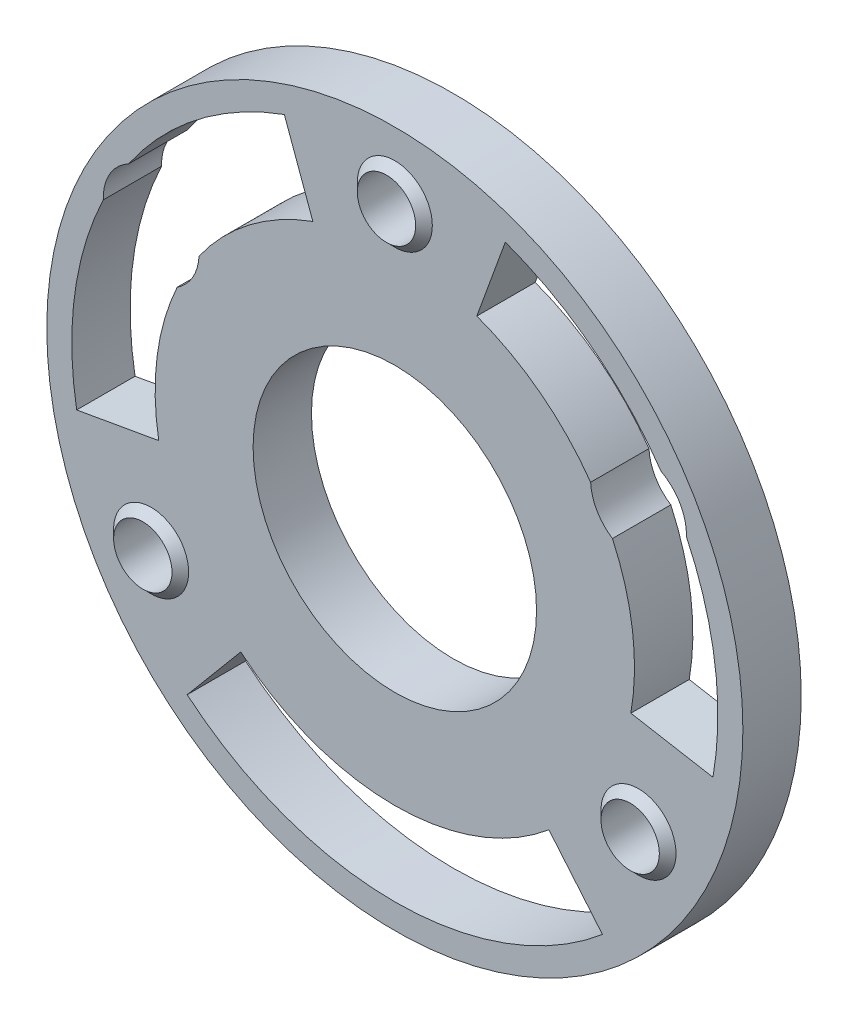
ISO-10303-21;
HEADER;
FILE_DESCRIPTION(('STEP AP214'),'2;1');
FILE_NAME('part.step','',(''),(''),'','','');
FILE_SCHEMA(('AUTOMOTIVE_DESIGN { 1 0 10303 214 1 1 1 1 }'));
ENDSEC;
DATA;
#1=APPLICATION_CONTEXT('core data for automotive mechanical design processes');
#2=APPLICATION_PROTOCOL_DEFINITION('international standard','automotive_design',2000,#1);
#3=PRODUCT_CONTEXT('',#1,'mechanical');
#4=PRODUCT('Part','Part','',(#3));
#5=PRODUCT_RELATED_PRODUCT_CATEGORY('part','',(#4));
#6=PRODUCT_DEFINITION_FORMATION('','',#4);
#7=PRODUCT_DEFINITION_CONTEXT('part definition',#1,'design');
#8=PRODUCT_DEFINITION('design','',#6,#7);
#9=PRODUCT_DEFINITION_SHAPE('','',#8);
#10=(LENGTH_UNIT() NAMED_UNIT(*) SI_UNIT(.MILLI.,.METRE.));
#11=(NAMED_UNIT(*) PLANE_ANGLE_UNIT() SI_UNIT($,.RADIAN.));
#12=(NAMED_UNIT(*) SI_UNIT($,.STERADIAN.) SOLID_ANGLE_UNIT());
#13=UNCERTAINTY_MEASURE_WITH_UNIT(LENGTH_MEASURE(1.E-05),#10,'distance_accuracy_value','');
#14=(GEOMETRIC_REPRESENTATION_CONTEXT(3) GLOBAL_UNCERTAINTY_ASSIGNED_CONTEXT((#13)) GLOBAL_UNIT_ASSIGNED_CONTEXT((#10,
#11,#12)) REPRESENTATION_CONTEXT('',''));
#15=CARTESIAN_POINT('',(0.,0.,0.));
#16=DIRECTION('',(0.,0.,1.));
#17=DIRECTION('',(1.,0.,0.));
#18=AXIS2_PLACEMENT_3D('',#15,#16,#17);
#19=CARTESIAN_POINT('',(0.,0.,3.5));
#20=DIRECTION('',(0.,0.,-1.));
#21=DIRECTION('',(-1.,0.,0.));
#22=AXIS2_PLACEMENT_3D('',#19,#20,#21);
#23=CYLINDRICAL_SURFACE('',#22,14.375);
#24=DIRECTION('',(0.,0.,-1.));
#25=VECTOR('',#24,1.);
#26=CARTESIAN_POINT('',(-11.7429006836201,8.2912549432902,2.));
#27=LINE('',#26,#25);
#28=CARTESIAN_POINT('',(-11.7429006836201,8.2912549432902,3.5));
#29=VERTEX_POINT('',#28);
#30=CARTESIAN_POINT('',(-11.7429006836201,8.2912549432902,0.));
#31=VERTEX_POINT('',#30);
#32=EDGE_CURVE('E435',#29,#31,#27,.T.);
#33=ORIENTED_EDGE('',*,*,#32,.F.);
#34=CARTESIAN_POINT('',(0.,0.,3.5));
#35=DIRECTION('',(0.,0.,-1.));
#36=DIRECTION('',(-1.,0.,0.));
#37=AXIS2_PLACEMENT_3D('',#34,#35,#36);
#38=CIRCLE('',#37,14.375);
#39=CARTESIAN_POINT('',(-4.9165395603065,13.5080814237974,3.5));
#40=VERTEX_POINT('',#39);
#41=EDGE_CURVE('E247',#29,#40,#38,.T.);
#42=ORIENTED_EDGE('',*,*,#41,.T.);
#43=DIRECTION('',(0.,0.,-1.));
#44=VECTOR('',#43,1.);
#45=CARTESIAN_POINT('',(-4.9165395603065,13.5080814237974,3.5));
#46=LINE('',#45,#44);
#47=CARTESIAN_POINT('',(-4.9165395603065,13.5080814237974,0.));
#48=VERTEX_POINT('',#47);
#49=EDGE_CURVE('E286',#40,#48,#46,.T.);
#50=ORIENTED_EDGE('',*,*,#49,.T.);
#51=CARTESIAN_POINT('',(0.,0.,0.));
#52=DIRECTION('',(0.,0.,-1.));
#53=DIRECTION('',(-1.,0.,0.));
#54=AXIS2_PLACEMENT_3D('',#51,#52,#53);
#55=CIRCLE('',#54,14.375);
#56=EDGE_CURVE('E241',#31,#48,#55,.T.);
#57=ORIENTED_EDGE('',*,*,#56,.F.);
#58=EDGE_LOOP('',(#33,#42,#50,#57));
#59=FACE_BOUND('',#58,.T.);
#60=ADVANCED_FACE('F45',(#59),#23,.T.);
#61=CARTESIAN_POINT('',(1.17961196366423E-13,0.,3.5));
#62=DIRECTION('',(0.,0.,-1.));
#63=DIRECTION('',(-1.,0.,0.));
#64=AXIS2_PLACEMENT_3D('',#61,#62,#63);
#65=CYLINDRICAL_SURFACE('',#64,19.3750000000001);
#66=DIRECTION('',(0.,0.,-1.));
#67=VECTOR('',#66,1.);
#68=CARTESIAN_POINT('',(-15.9674769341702,10.9740742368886,2.));
#69=LINE('',#68,#67);
#70=CARTESIAN_POINT('',(-15.9674769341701,10.9740742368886,0.));
#71=VERTEX_POINT('',#70);
#72=CARTESIAN_POINT('',(-15.9674769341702,10.9740742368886,3.5));
#73=VERTEX_POINT('',#72);
#74=EDGE_CURVE('E11',#71,#73,#69,.F.);
#75=ORIENTED_EDGE('',*,*,#74,.F.);
#76=CARTESIAN_POINT('',(1.17961196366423E-13,0.,0.));
#77=DIRECTION('',(0.,0.,1.));
#78=DIRECTION('',(-1.,0.,0.));
#79=AXIS2_PLACEMENT_3D('',#76,#77,#78);
#80=CIRCLE('',#79,19.3750000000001);
#81=CARTESIAN_POINT('',(-6.62664027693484,18.206544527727,0.));
#82=VERTEX_POINT('',#81);
#83=EDGE_CURVE('E268',#82,#71,#80,.T.);
#84=ORIENTED_EDGE('',*,*,#83,.F.);
#85=DIRECTION('',(0.,0.,-1.));
#86=VECTOR('',#85,1.);
#87=CARTESIAN_POINT('',(-6.62664027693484,18.206544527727,3.5));
#88=LINE('',#87,#86);
#89=CARTESIAN_POINT('',(-6.62664027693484,18.206544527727,3.5));
#90=VERTEX_POINT('',#89);
#91=EDGE_CURVE('E283',#90,#82,#88,.T.);
#92=ORIENTED_EDGE('',*,*,#91,.F.);
#93=CARTESIAN_POINT('',(1.17961196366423E-13,0.,3.5));
#94=DIRECTION('',(0.,0.,1.));
#95=DIRECTION('',(-1.,0.,0.));
#96=AXIS2_PLACEMENT_3D('',#93,#94,#95);
#97=CIRCLE('',#96,19.3750000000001);
#98=EDGE_CURVE('E251',#90,#73,#97,.T.);
#99=ORIENTED_EDGE('',*,*,#98,.T.);
#100=EDGE_LOOP('',(#75,#84,#92,#99));
#101=FACE_BOUND('',#100,.T.);
#102=ADVANCED_FACE('F486',(#101),#65,.F.);
#103=CARTESIAN_POINT('',(0.,0.,3.5));
#104=DIRECTION('',(0.,0.,-1.));
#105=DIRECTION('',(-1.,0.,0.));
#106=AXIS2_PLACEMENT_3D('',#103,#104,#105);
#107=CYLINDRICAL_SURFACE('',#106,14.375);
#108=DIRECTION('',(0.,0.,-1.));
#109=VECTOR('',#108,1.);
#110=CARTESIAN_POINT('',(13.0518877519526,6.02402283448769,2.));
#111=LINE('',#110,#109);
#112=CARTESIAN_POINT('',(13.0518877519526,6.02402283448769,3.5));
#113=VERTEX_POINT('',#112);
#114=CARTESIAN_POINT('',(13.0518877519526,6.02402283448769,0.));
#115=VERTEX_POINT('',#114);
#116=EDGE_CURVE('E444',#113,#115,#111,.T.);
#117=ORIENTED_EDGE('',*,*,#116,.F.);
#118=CARTESIAN_POINT('',(0.,0.,3.5));
#119=DIRECTION('',(0.,0.,-1.));
#120=DIRECTION('',(-1.,0.,0.));
#121=AXIS2_PLACEMENT_3D('',#118,#119,#120);
#122=CIRCLE('',#121,14.375);
#123=CARTESIAN_POINT('',(14.1566114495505,-2.49619255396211,3.5));
#124=VERTEX_POINT('',#123);
#125=EDGE_CURVE('E226',#113,#124,#122,.T.);
#126=ORIENTED_EDGE('',*,*,#125,.T.);
#127=DIRECTION('',(0.,0.,-1.));
#128=VECTOR('',#127,1.);
#129=CARTESIAN_POINT('',(14.1566114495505,-2.49619255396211,3.5));
#130=LINE('',#129,#128);
#131=CARTESIAN_POINT('',(14.1566114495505,-2.49619255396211,0.));
#132=VERTEX_POINT('',#131);
#133=EDGE_CURVE('E237',#124,#132,#130,.T.);
#134=ORIENTED_EDGE('',*,*,#133,.T.);
#135=CARTESIAN_POINT('',(0.,0.,0.));
#136=DIRECTION('',(0.,0.,-1.));
#137=DIRECTION('',(-1.,0.,0.));
#138=AXIS2_PLACEMENT_3D('',#135,#136,#137);
#139=CIRCLE('',#138,14.375);
#140=EDGE_CURVE('E360',#115,#132,#139,.T.);
#141=ORIENTED_EDGE('',*,*,#140,.F.);
#142=EDGE_LOOP('',(#117,#126,#134,#141));
#143=FACE_BOUND('',#142,.T.);
#144=ADVANCED_FACE('F459',(#143),#107,.T.);
#145=CARTESIAN_POINT('',(1.17961196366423E-13,0.,3.5));
#146=DIRECTION('',(0.,0.,-1.));
#147=DIRECTION('',(-1.,0.,0.));
#148=AXIS2_PLACEMENT_3D('',#145,#146,#147);
#149=CYLINDRICAL_SURFACE('',#148,19.3749999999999);
#150=DIRECTION('',(0.,0.,-1.));
#151=VECTOR('',#150,1.);
#152=CARTESIAN_POINT('',(17.4875655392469,8.3412035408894,2.));
#153=LINE('',#152,#151);
#154=CARTESIAN_POINT('',(17.4875655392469,8.34120354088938,0.));
#155=VERTEX_POINT('',#154);
#156=CARTESIAN_POINT('',(17.4875655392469,8.3412035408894,3.5));
#157=VERTEX_POINT('',#156);
#158=EDGE_CURVE('E193',#155,#157,#153,.F.);
#159=ORIENTED_EDGE('',*,*,#158,.F.);
#160=CARTESIAN_POINT('',(1.17961196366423E-13,0.,0.));
#161=DIRECTION('',(0.,0.,1.));
#162=DIRECTION('',(-1.,0.,0.));
#163=AXIS2_PLACEMENT_3D('',#160,#161,#162);
#164=CIRCLE('',#163,19.3749999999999);
#165=CARTESIAN_POINT('',(19.0806502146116,-3.36443344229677,0.));
#166=VERTEX_POINT('',#165);
#167=EDGE_CURVE('E206',#166,#155,#164,.T.);
#168=ORIENTED_EDGE('',*,*,#167,.F.);
#169=DIRECTION('',(0.,0.,-1.));
#170=VECTOR('',#169,1.);
#171=CARTESIAN_POINT('',(19.0806502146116,-3.36443344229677,3.5));
#172=LINE('',#171,#170);
#173=CARTESIAN_POINT('',(19.0806502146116,-3.36443344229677,3.5));
#174=VERTEX_POINT('',#173);
#175=EDGE_CURVE('E234',#174,#166,#172,.T.);
#176=ORIENTED_EDGE('',*,*,#175,.F.);
#177=CARTESIAN_POINT('',(1.17961196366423E-13,0.,3.5));
#178=DIRECTION('',(0.,0.,1.));
#179=DIRECTION('',(-1.,0.,0.));
#180=AXIS2_PLACEMENT_3D('',#177,#178,#179);
#181=CIRCLE('',#180,19.3749999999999);
#182=EDGE_CURVE('E338',#174,#157,#181,.T.);
#183=ORIENTED_EDGE('',*,*,#182,.T.);
#184=EDGE_LOOP('',(#159,#168,#176,#183));
#185=FACE_BOUND('',#184,.T.);
#186=ADVANCED_FACE('F468',(#185),#149,.F.);
#187=CARTESIAN_POINT('',(1.17961196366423E-13,0.,3.5));
#188=DIRECTION('',(0.,0.,1.));
#189=DIRECTION('',(1.,0.,0.));
#190=AXIS2_PLACEMENT_3D('',#187,#188,#189);
#191=PLANE('',#190);
#192=CARTESIAN_POINT('',(14.6141786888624,8.43750000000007,3.5));
#193=DIRECTION('',(0.,0.,1.));
#194=DIRECTION('',(1.,0.,0.));
#195=AXIS2_PLACEMENT_3D('',#192,#193,#194);
#196=CIRCLE('',#195,2.875);
#197=CARTESIAN_POINT('',(11.7429006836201,8.2912549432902,3.5));
#198=VERTEX_POINT('',#197);
#199=EDGE_CURVE('E447',#198,#113,#196,.T.);
#200=ORIENTED_EDGE('',*,*,#199,.F.);
#201=CARTESIAN_POINT('',(4.91653956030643,13.5080814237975,3.5));
#202=VERTEX_POINT('',#201);
#203=EDGE_CURVE('E347',#202,#198,#122,.T.);
#204=ORIENTED_EDGE('',*,*,#203,.F.);
#205=DIRECTION('',(-0.342020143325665,-0.93969262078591,0.));
#206=VECTOR('',#205,1.);
#207=CARTESIAN_POINT('',(6.62664027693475,18.206544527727,3.5));
#208=LINE('',#207,#206);
#209=CARTESIAN_POINT('',(6.62664027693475,18.206544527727,3.5));
#210=VERTEX_POINT('',#209);
#211=EDGE_CURVE('E231',#210,#202,#208,.T.);
#212=ORIENTED_EDGE('',*,*,#211,.F.);
#213=CARTESIAN_POINT('',(15.9674769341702,10.9740742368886,3.5));
#214=VERTEX_POINT('',#213);
#215=EDGE_CURVE('E342',#214,#210,#181,.T.);
#216=ORIENTED_EDGE('',*,*,#215,.F.);
#217=EDGE_CURVE('E188',#157,#214,#196,.T.);
#218=ORIENTED_EDGE('',*,*,#217,.F.);
#219=ORIENTED_EDGE('',*,*,#182,.F.);
#220=DIRECTION('',(0.984807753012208,-0.173648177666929,0.));
#221=VECTOR('',#220,1.);
#222=CARTESIAN_POINT('',(19.0806502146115,-3.36443344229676,3.5));
#223=LINE('',#222,#221);
#224=EDGE_CURVE('E345',#124,#174,#223,.T.);
#225=ORIENTED_EDGE('',*,*,#224,.F.);
#226=ORIENTED_EDGE('',*,*,#125,.F.);
#227=EDGE_LOOP('',(#200,#204,#212,#216,#218,#219,#225,#226));
#228=FACE_BOUND('',#227,.T.);
#229=CARTESIAN_POINT('',(-14.6141786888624,8.43750000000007,3.5));
#230=DIRECTION('',(0.,0.,1.));
#231=DIRECTION('',(1.,0.,0.));
#232=AXIS2_PLACEMENT_3D('',#229,#230,#231);
#233=CIRCLE('',#232,2.875);
#234=CARTESIAN_POINT('',(-17.4875655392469,8.34120354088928,3.5));
#235=VERTEX_POINT('',#234);
#236=EDGE_CURVE('E69',#73,#235,#233,.T.);
#237=ORIENTED_EDGE('',*,*,#236,.F.);
#238=ORIENTED_EDGE('',*,*,#98,.F.);
#239=DIRECTION('',(-0.342020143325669,0.939692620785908,0.));
#240=VECTOR('',#239,1.);
#241=CARTESIAN_POINT('',(-6.62664027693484,18.206544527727,3.5));
#242=LINE('',#241,#240);
#243=EDGE_CURVE('E246',#40,#90,#242,.T.);
#244=ORIENTED_EDGE('',*,*,#243,.F.);
#245=ORIENTED_EDGE('',*,*,#41,.F.);
#246=CARTESIAN_POINT('',(-13.0518877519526,6.02402283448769,3.5));
#247=VERTEX_POINT('',#246);
#248=EDGE_CURVE('E438',#247,#29,#233,.T.);
#249=ORIENTED_EDGE('',*,*,#248,.F.);
#250=CARTESIAN_POINT('',(-14.1566114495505,-2.49619255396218,3.5));
#251=VERTEX_POINT('',#250);
#252=EDGE_CURVE('E242',#251,#247,#38,.T.);
#253=ORIENTED_EDGE('',*,*,#252,.F.);
#254=DIRECTION('',(0.984807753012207,0.173648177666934,0.));
#255=VECTOR('',#254,1.);
#256=CARTESIAN_POINT('',(-19.0806502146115,-3.36443344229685,3.5));
#257=LINE('',#256,#255);
#258=CARTESIAN_POINT('',(-19.0806502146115,-3.36443344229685,3.5));
#259=VERTEX_POINT('',#258);
#260=EDGE_CURVE('E255',#259,#251,#257,.T.);
#261=ORIENTED_EDGE('',*,*,#260,.F.);
#262=EDGE_CURVE('E250',#235,#259,#97,.T.);
#263=ORIENTED_EDGE('',*,*,#262,.F.);
#264=EDGE_LOOP('',(#237,#238,#244,#245,#249,#253,#261,#263));
#265=FACE_BOUND('',#264,.T.);
#266=CARTESIAN_POINT('',(-14.6141786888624,-8.43750000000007,3.5));
#267=DIRECTION('',(0.,0.,1.));
#268=DIRECTION('',(1.,0.,0.));
#269=AXIS2_PLACEMENT_3D('',#266,#267,#268);
#270=CIRCLE('',#269,2.25);
#271=CARTESIAN_POINT('',(-12.3641786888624,-8.43750000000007,3.5));
#272=VERTEX_POINT('',#271);
#273=EDGE_CURVE('E423',#272,#272,#270,.T.);
#274=ORIENTED_EDGE('',*,*,#273,.F.);
#275=EDGE_LOOP('',(#274));
#276=FACE_BOUND('',#275,.T.);
#277=DIRECTION('',(-0.642787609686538,-0.766044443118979,0.));
#278=VECTOR('',#277,1.);
#279=CARTESIAN_POINT('',(-12.4540099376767,-14.8421110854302,3.5));
#280=LINE('',#279,#278);
#281=CARTESIAN_POINT('',(-9.24007188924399,-11.0118888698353,3.5));
#282=VERTEX_POINT('',#281);
#283=CARTESIAN_POINT('',(-12.4540099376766,-14.8421110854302,3.5));
#284=VERTEX_POINT('',#283);
#285=EDGE_CURVE('E407',#282,#284,#280,.T.);
#286=ORIENTED_EDGE('',*,*,#285,.F.);
#287=CARTESIAN_POINT('',(0.,0.,3.5));
#288=DIRECTION('',(0.,0.,-1.));
#289=DIRECTION('',(-1.,0.,0.));
#290=AXIS2_PLACEMENT_3D('',#287,#288,#289);
#291=CIRCLE('',#290,14.375);
#292=CARTESIAN_POINT('',(9.24007188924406,-11.0118888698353,3.5));
#293=VERTEX_POINT('',#292);
#294=EDGE_CURVE('E388',#293,#282,#291,.T.);
#295=ORIENTED_EDGE('',*,*,#294,.F.);
#296=DIRECTION('',(-0.642787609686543,0.766044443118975,0.));
#297=VECTOR('',#296,1.);
#298=CARTESIAN_POINT('',(12.4540099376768,-14.8421110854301,3.5));
#299=LINE('',#298,#297);
#300=CARTESIAN_POINT('',(12.4540099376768,-14.8421110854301,3.5));
#301=VERTEX_POINT('',#300);
#302=EDGE_CURVE('E383',#301,#293,#299,.T.);
#303=ORIENTED_EDGE('',*,*,#302,.F.);
#304=CARTESIAN_POINT('',(1.17961196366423E-13,0.,3.5));
#305=DIRECTION('',(0.,0.,1.));
#306=DIRECTION('',(-1.,0.,0.));
#307=AXIS2_PLACEMENT_3D('',#304,#305,#306);
#308=CIRCLE('',#307,19.3749999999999);
#309=EDGE_CURVE('E403',#284,#301,#308,.T.);
#310=ORIENTED_EDGE('',*,*,#309,.F.);
#311=EDGE_LOOP('',(#286,#295,#303,#310));
#312=FACE_BOUND('',#311,.T.);
#313=CARTESIAN_POINT('',(1.17961196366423E-13,0.,3.5));
#314=DIRECTION('',(0.,0.,1.));
#315=DIRECTION('',(1.,0.,0.));
#316=AXIS2_PLACEMENT_3D('',#313,#314,#315);
#317=CIRCLE('',#316,20.875);
#318=CARTESIAN_POINT('',(20.8750000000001,0.,3.5));
#319=VERTEX_POINT('',#318);
#320=EDGE_CURVE('E194',#319,#319,#317,.T.);
#321=ORIENTED_EDGE('',*,*,#320,.T.);
#322=EDGE_LOOP('',(#321));
#323=FACE_BOUND('',#322,.T.);
#324=CARTESIAN_POINT('',(1.17961196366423E-13,0.,3.5));
#325=DIRECTION('',(0.,0.,1.));
#326=DIRECTION('',(1.,0.,0.));
#327=AXIS2_PLACEMENT_3D('',#324,#325,#326);
#328=CIRCLE('',#327,8.49999999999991);
#329=CARTESIAN_POINT('',(8.50000000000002,0.,3.5));
#330=VERTEX_POINT('',#329);
#331=EDGE_CURVE('E303',#330,#330,#328,.T.);
#332=ORIENTED_EDGE('',*,*,#331,.F.);
#333=EDGE_LOOP('',(#332));
#334=FACE_BOUND('',#333,.T.);
#335=CARTESIAN_POINT('',(0.,16.875,3.5));
#336=DIRECTION('',(0.,0.,1.));
#337=DIRECTION('',(1.,0.,0.));
#338=AXIS2_PLACEMENT_3D('',#335,#336,#337);
#339=CIRCLE('',#338,2.25);
#340=CARTESIAN_POINT('',(2.25,16.875,3.5));
#341=VERTEX_POINT('',#340);
#342=EDGE_CURVE('E400',#341,#341,#339,.T.);
#343=ORIENTED_EDGE('',*,*,#342,.F.);
#344=EDGE_LOOP('',(#343));
#345=FACE_BOUND('',#344,.T.);
#346=CARTESIAN_POINT('',(14.6141786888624,-8.43750000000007,3.5));
#347=DIRECTION('',(0.,0.,1.));
#348=DIRECTION('',(1.,0.,0.));
#349=AXIS2_PLACEMENT_3D('',#346,#347,#348);
#350=CIRCLE('',#349,2.25);
#351=CARTESIAN_POINT('',(16.8641786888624,-8.43750000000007,3.5));
#352=VERTEX_POINT('',#351);
#353=EDGE_CURVE('E431',#352,#352,#350,.T.);
#354=ORIENTED_EDGE('',*,*,#353,.F.);
#355=EDGE_LOOP('',(#354));
#356=FACE_BOUND('',#355,.T.);
#357=ADVANCED_FACE('F461',(#228,#265,#276,#312,#323,#334,#345,#356),#191,.T.);
#358=CARTESIAN_POINT('',(1.17961196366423E-13,0.,0.));
#359=DIRECTION('',(0.,0.,1.));
#360=DIRECTION('',(1.,0.,0.));
#361=AXIS2_PLACEMENT_3D('',#358,#359,#360);
#362=PLANE('',#361);
#363=CARTESIAN_POINT('',(4.91653956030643,13.5080814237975,0.));
#364=VERTEX_POINT('',#363);
#365=CARTESIAN_POINT('',(11.7429006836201,8.29125494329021,0.));
#366=VERTEX_POINT('',#365);
#367=EDGE_CURVE('E220',#364,#366,#139,.T.);
#368=ORIENTED_EDGE('',*,*,#367,.T.);
#369=CARTESIAN_POINT('',(14.6141786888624,8.43750000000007,0.));
#370=DIRECTION('',(0.,0.,-1.));
#371=DIRECTION('',(-1.,0.,0.));
#372=AXIS2_PLACEMENT_3D('',#369,#370,#371);
#373=CIRCLE('',#372,2.875);
#374=EDGE_CURVE('E208',#115,#366,#373,.T.);
#375=ORIENTED_EDGE('',*,*,#374,.F.);
#376=ORIENTED_EDGE('',*,*,#140,.T.);
#377=DIRECTION('',(0.984807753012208,-0.173648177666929,0.));
#378=VECTOR('',#377,1.);
#379=CARTESIAN_POINT('',(19.0806502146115,-3.36443344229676,0.));
#380=LINE('',#379,#378);
#381=EDGE_CURVE('E215',#132,#166,#380,.T.);
#382=ORIENTED_EDGE('',*,*,#381,.T.);
#383=ORIENTED_EDGE('',*,*,#167,.T.);
#384=CARTESIAN_POINT('',(15.9674769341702,10.9740742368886,0.));
#385=VERTEX_POINT('',#384);
#386=EDGE_CURVE('E185',#385,#155,#373,.T.);
#387=ORIENTED_EDGE('',*,*,#386,.F.);
#388=CARTESIAN_POINT('',(6.62664027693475,18.206544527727,0.));
#389=VERTEX_POINT('',#388);
#390=EDGE_CURVE('E202',#385,#389,#164,.T.);
#391=ORIENTED_EDGE('',*,*,#390,.T.);
#392=DIRECTION('',(-0.342020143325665,-0.93969262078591,0.));
#393=VECTOR('',#392,1.);
#394=CARTESIAN_POINT('',(6.62664027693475,18.206544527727,0.));
#395=LINE('',#394,#393);
#396=EDGE_CURVE('E219',#389,#364,#395,.T.);
#397=ORIENTED_EDGE('',*,*,#396,.T.);
#398=EDGE_LOOP('',(#368,#375,#376,#382,#383,#387,#391,#397));
#399=FACE_BOUND('',#398,.T.);
#400=CARTESIAN_POINT('',(14.6141786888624,-8.43750000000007,0.));
#401=DIRECTION('',(0.,0.,1.));
#402=DIRECTION('',(1.,0.,0.));
#403=AXIS2_PLACEMENT_3D('',#400,#401,#402);
#404=CIRCLE('',#403,1.75);
#405=CARTESIAN_POINT('',(16.3641786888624,-8.43750000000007,0.));
#406=VERTEX_POINT('',#405);
#407=EDGE_CURVE('E290',#406,#406,#404,.T.);
#408=ORIENTED_EDGE('',*,*,#407,.T.);
#409=EDGE_LOOP('',(#408));
#410=FACE_BOUND('',#409,.T.);
#411=CARTESIAN_POINT('',(-14.6141786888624,-8.43750000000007,0.));
#412=DIRECTION('',(0.,0.,1.));
#413=DIRECTION('',(1.,0.,0.));
#414=AXIS2_PLACEMENT_3D('',#411,#412,#413);
#415=CIRCLE('',#414,1.75);
#416=CARTESIAN_POINT('',(-12.8641786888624,-8.43750000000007,0.));
#417=VERTEX_POINT('',#416);
#418=EDGE_CURVE('E294',#417,#417,#415,.T.);
#419=ORIENTED_EDGE('',*,*,#418,.T.);
#420=EDGE_LOOP('',(#419));
#421=FACE_BOUND('',#420,.T.);
#422=CARTESIAN_POINT('',(0.,16.875,0.));
#423=DIRECTION('',(0.,0.,1.));
#424=DIRECTION('',(1.,0.,0.));
#425=AXIS2_PLACEMENT_3D('',#422,#423,#424);
#426=CIRCLE('',#425,1.75);
#427=CARTESIAN_POINT('',(1.75,16.875,0.));
#428=VERTEX_POINT('',#427);
#429=EDGE_CURVE('E298',#428,#428,#426,.T.);
#430=ORIENTED_EDGE('',*,*,#429,.T.);
#431=EDGE_LOOP('',(#430));
#432=FACE_BOUND('',#431,.T.);
#433=CARTESIAN_POINT('',(1.17961196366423E-13,0.,0.));
#434=DIRECTION('',(0.,0.,1.));
#435=DIRECTION('',(1.,0.,0.));
#436=AXIS2_PLACEMENT_3D('',#433,#434,#435);
#437=CIRCLE('',#436,8.49999999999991);
#438=CARTESIAN_POINT('',(8.50000000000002,0.,0.));
#439=VERTEX_POINT('',#438);
#440=EDGE_CURVE('E302',#439,#439,#437,.T.);
#441=ORIENTED_EDGE('',*,*,#440,.T.);
#442=EDGE_LOOP('',(#441));
#443=FACE_BOUND('',#442,.T.);
#444=CARTESIAN_POINT('',(1.17961196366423E-13,0.,0.));
#445=DIRECTION('',(0.,0.,1.));
#446=DIRECTION('',(1.,0.,0.));
#447=AXIS2_PLACEMENT_3D('',#444,#445,#446);
#448=CIRCLE('',#447,20.875);
#449=CARTESIAN_POINT('',(20.8750000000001,0.,0.));
#450=VERTEX_POINT('',#449);
#451=EDGE_CURVE('E307',#450,#450,#448,.T.);
#452=ORIENTED_EDGE('',*,*,#451,.F.);
#453=EDGE_LOOP('',(#452));
#454=FACE_BOUND('',#453,.T.);
#455=ORIENTED_EDGE('',*,*,#83,.T.);
#456=CARTESIAN_POINT('',(-14.6141786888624,8.43750000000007,0.));
#457=DIRECTION('',(0.,0.,-1.));
#458=DIRECTION('',(-1.,0.,0.));
#459=AXIS2_PLACEMENT_3D('',#456,#457,#458);
#460=CIRCLE('',#459,2.875);
#461=CARTESIAN_POINT('',(-17.4875655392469,8.34120354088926,0.));
#462=VERTEX_POINT('',#461);
#463=EDGE_CURVE('E321',#462,#71,#460,.T.);
#464=ORIENTED_EDGE('',*,*,#463,.F.);
#465=CARTESIAN_POINT('',(-19.0806502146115,-3.36443344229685,0.));
#466=VERTEX_POINT('',#465);
#467=EDGE_CURVE('E267',#462,#466,#80,.T.);
#468=ORIENTED_EDGE('',*,*,#467,.T.);
#469=DIRECTION('',(0.984807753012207,0.173648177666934,0.));
#470=VECTOR('',#469,1.);
#471=CARTESIAN_POINT('',(-19.0806502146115,-3.36443344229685,0.));
#472=LINE('',#471,#470);
#473=CARTESIAN_POINT('',(-14.1566114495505,-2.49619255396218,0.));
#474=VERTEX_POINT('',#473);
#475=EDGE_CURVE('E272',#466,#474,#472,.T.);
#476=ORIENTED_EDGE('',*,*,#475,.T.);
#477=CARTESIAN_POINT('',(-13.0518877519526,6.0240228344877,0.));
#478=VERTEX_POINT('',#477);
#479=EDGE_CURVE('E259',#474,#478,#55,.T.);
#480=ORIENTED_EDGE('',*,*,#479,.T.);
#481=EDGE_CURVE('E62',#31,#478,#460,.T.);
#482=ORIENTED_EDGE('',*,*,#481,.F.);
#483=ORIENTED_EDGE('',*,*,#56,.T.);
#484=DIRECTION('',(-0.342020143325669,0.939692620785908,0.));
#485=VECTOR('',#484,1.);
#486=CARTESIAN_POINT('',(-6.62664027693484,18.206544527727,0.));
#487=LINE('',#486,#485);
#488=EDGE_CURVE('E263',#48,#82,#487,.T.);
#489=ORIENTED_EDGE('',*,*,#488,.T.);
#490=EDGE_LOOP('',(#455,#464,#468,#476,#480,#482,#483,#489));
#491=FACE_BOUND('',#490,.T.);
#492=CARTESIAN_POINT('',(0.,0.,0.));
#493=DIRECTION('',(0.,0.,-1.));
#494=DIRECTION('',(-1.,0.,0.));
#495=AXIS2_PLACEMENT_3D('',#492,#493,#494);
#496=CIRCLE('',#495,14.375);
#497=CARTESIAN_POINT('',(9.24007188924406,-11.0118888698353,0.));
#498=VERTEX_POINT('',#497);
#499=CARTESIAN_POINT('',(-9.24007188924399,-11.0118888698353,0.));
#500=VERTEX_POINT('',#499);
#501=EDGE_CURVE('E397',#498,#500,#496,.T.);
#502=ORIENTED_EDGE('',*,*,#501,.T.);
#503=DIRECTION('',(-0.642787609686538,-0.766044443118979,0.));
#504=VECTOR('',#503,1.);
#505=CARTESIAN_POINT('',(-12.4540099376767,-14.8421110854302,0.));
#506=LINE('',#505,#504);
#507=CARTESIAN_POINT('',(-12.4540099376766,-14.8421110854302,0.));
#508=VERTEX_POINT('',#507);
#509=EDGE_CURVE('E393',#500,#508,#506,.T.);
#510=ORIENTED_EDGE('',*,*,#509,.T.);
#511=CARTESIAN_POINT('',(1.17961196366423E-13,0.,0.));
#512=DIRECTION('',(0.,0.,1.));
#513=DIRECTION('',(-1.,0.,0.));
#514=AXIS2_PLACEMENT_3D('',#511,#512,#513);
#515=CIRCLE('',#514,19.3749999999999);
#516=CARTESIAN_POINT('',(12.4540099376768,-14.8421110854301,0.));
#517=VERTEX_POINT('',#516);
#518=EDGE_CURVE('E389',#508,#517,#515,.T.);
#519=ORIENTED_EDGE('',*,*,#518,.T.);
#520=DIRECTION('',(-0.642787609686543,0.766044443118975,0.));
#521=VECTOR('',#520,1.);
#522=CARTESIAN_POINT('',(12.4540099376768,-14.8421110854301,0.));
#523=LINE('',#522,#521);
#524=EDGE_CURVE('E384',#517,#498,#523,.T.);
#525=ORIENTED_EDGE('',*,*,#524,.T.);
#526=EDGE_LOOP('',(#502,#510,#519,#525));
#527=FACE_BOUND('',#526,.T.);
#528=ADVANCED_FACE('F199',(#399,#410,#421,#432,#443,#454,#491,#527),#362,.F.);
#529=CARTESIAN_POINT('',(1.17961196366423E-13,0.,3.5));
#530=DIRECTION('',(0.,0.,-1.));
#531=DIRECTION('',(-1.,0.,0.));
#532=AXIS2_PLACEMENT_3D('',#529,#530,#531);
#533=CYLINDRICAL_SURFACE('',#532,20.875);
#534=ORIENTED_EDGE('',*,*,#320,.F.);
#535=EDGE_LOOP('',(#534));
#536=FACE_BOUND('',#535,.T.);
#537=ORIENTED_EDGE('',*,*,#451,.T.);
#538=EDGE_LOOP('',(#537));
#539=FACE_BOUND('',#538,.T.);
#540=ADVANCED_FACE('F565',(#536,#539),#533,.T.);
#541=CARTESIAN_POINT('',(1.17961196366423E-13,0.,3.5));
#542=DIRECTION('',(0.,0.,-1.));
#543=DIRECTION('',(-1.,0.,0.));
#544=AXIS2_PLACEMENT_3D('',#541,#542,#543);
#545=CYLINDRICAL_SURFACE('',#544,8.49999999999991);
#546=ORIENTED_EDGE('',*,*,#331,.T.);
#547=EDGE_LOOP('',(#546));
#548=FACE_BOUND('',#547,.T.);
#549=ORIENTED_EDGE('',*,*,#440,.F.);
#550=EDGE_LOOP('',(#549));
#551=FACE_BOUND('',#550,.T.);
#552=ADVANCED_FACE('F568',(#548,#551),#545,.F.);
#553=CARTESIAN_POINT('',(0.,16.875,3.5));
#554=DIRECTION('',(0.,0.,-1.));
#555=DIRECTION('',(-1.,0.,0.));
#556=AXIS2_PLACEMENT_3D('',#553,#554,#555);
#557=CYLINDRICAL_SURFACE('',#556,1.75);
#558=ORIENTED_EDGE('',*,*,#429,.F.);
#559=EDGE_LOOP('',(#558));
#560=FACE_BOUND('',#559,.T.);
#561=CARTESIAN_POINT('',(0.,16.875,4.));
#562=DIRECTION('',(0.,0.,1.));
#563=DIRECTION('',(1.,0.,0.));
#564=AXIS2_PLACEMENT_3D('',#561,#562,#563);
#565=CIRCLE('',#564,1.75);
#566=CARTESIAN_POINT('',(1.75,16.875,4.));
#567=VERTEX_POINT('',#566);
#568=EDGE_CURVE('E415',#567,#567,#565,.T.);
#569=ORIENTED_EDGE('',*,*,#568,.T.);
#570=EDGE_LOOP('',(#569));
#571=FACE_BOUND('',#570,.T.);
#572=ADVANCED_FACE('F590',(#560,#571),#557,.F.);
#573=CARTESIAN_POINT('',(-14.6141786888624,-8.43750000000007,3.5));
#574=DIRECTION('',(0.,0.,-1.));
#575=DIRECTION('',(-1.,0.,0.));
#576=AXIS2_PLACEMENT_3D('',#573,#574,#575);
#577=CYLINDRICAL_SURFACE('',#576,1.75);
#578=ORIENTED_EDGE('',*,*,#418,.F.);
#579=EDGE_LOOP('',(#578));
#580=FACE_BOUND('',#579,.T.);
#581=CARTESIAN_POINT('',(-14.6141786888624,-8.43750000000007,4.));
#582=DIRECTION('',(0.,0.,1.));
#583=DIRECTION('',(1.,0.,0.));
#584=AXIS2_PLACEMENT_3D('',#581,#582,#583);
#585=CIRCLE('',#584,1.75);
#586=CARTESIAN_POINT('',(-12.8641786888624,-8.43750000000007,4.));
#587=VERTEX_POINT('',#586);
#588=EDGE_CURVE('E419',#587,#587,#585,.T.);
#589=ORIENTED_EDGE('',*,*,#588,.T.);
#590=EDGE_LOOP('',(#589));
#591=FACE_BOUND('',#590,.T.);
#592=ADVANCED_FACE('F508',(#580,#591),#577,.F.);
#593=CARTESIAN_POINT('',(14.6141786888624,-8.43750000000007,3.5));
#594=DIRECTION('',(0.,0.,-1.));
#595=DIRECTION('',(-1.,0.,0.));
#596=AXIS2_PLACEMENT_3D('',#593,#594,#595);
#597=CYLINDRICAL_SURFACE('',#596,1.75);
#598=ORIENTED_EDGE('',*,*,#407,.F.);
#599=EDGE_LOOP('',(#598));
#600=FACE_BOUND('',#599,.T.);
#601=CARTESIAN_POINT('',(14.6141786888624,-8.43750000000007,4.));
#602=DIRECTION('',(0.,0.,1.));
#603=DIRECTION('',(1.,0.,0.));
#604=AXIS2_PLACEMENT_3D('',#601,#602,#603);
#605=CIRCLE('',#604,1.75);
#606=CARTESIAN_POINT('',(16.3641786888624,-8.43750000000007,4.));
#607=VERTEX_POINT('',#606);
#608=EDGE_CURVE('E427',#607,#607,#605,.T.);
#609=ORIENTED_EDGE('',*,*,#608,.T.);
#610=EDGE_LOOP('',(#609));
#611=FACE_BOUND('',#610,.T.);
#612=ADVANCED_FACE('F501',(#600,#611),#597,.F.);
#613=DIRECTION('',(0.,0.,-1.));
#614=VECTOR('',#613,1.);
#615=CARTESIAN_POINT('',(-13.0518877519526,6.02402283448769,2.));
#616=LINE('',#615,#614);
#617=EDGE_CURVE('E439',#478,#247,#616,.F.);
#618=ORIENTED_EDGE('',*,*,#617,.F.);
#619=ORIENTED_EDGE('',*,*,#479,.F.);
#620=DIRECTION('',(0.,0.,-1.));
#621=VECTOR('',#620,1.);
#622=CARTESIAN_POINT('',(-14.1566114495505,-2.49619255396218,3.5));
#623=LINE('',#622,#621);
#624=EDGE_CURVE('E258',#251,#474,#623,.T.);
#625=ORIENTED_EDGE('',*,*,#624,.F.);
#626=ORIENTED_EDGE('',*,*,#252,.T.);
#627=EDGE_LOOP('',(#618,#619,#625,#626));
#628=FACE_BOUND('',#627,.T.);
#629=ADVANCED_FACE('F490',(#628),#23,.T.);
#630=CARTESIAN_POINT('',(-6.62664027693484,18.206544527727,3.5));
#631=DIRECTION('',(-0.939692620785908,-0.342020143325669,0.));
#632=DIRECTION('',(0.342020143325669,-0.939692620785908,0.));
#633=AXIS2_PLACEMENT_3D('',#630,#631,#632);
#634=PLANE('',#633);
#635=ORIENTED_EDGE('',*,*,#488,.F.);
#636=ORIENTED_EDGE('',*,*,#49,.F.);
#637=ORIENTED_EDGE('',*,*,#243,.T.);
#638=ORIENTED_EDGE('',*,*,#91,.T.);
#639=EDGE_LOOP('',(#635,#636,#637,#638));
#640=FACE_BOUND('',#639,.T.);
#641=ADVANCED_FACE('F500',(#640),#634,.T.);
#642=DIRECTION('',(0.,0.,-1.));
#643=VECTOR('',#642,1.);
#644=CARTESIAN_POINT('',(-17.4875655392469,8.34120354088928,2.));
#645=LINE('',#644,#643);
#646=EDGE_CURVE('E55',#235,#462,#645,.T.);
#647=ORIENTED_EDGE('',*,*,#646,.F.);
#648=ORIENTED_EDGE('',*,*,#262,.T.);
#649=DIRECTION('',(0.,0.,-1.));
#650=VECTOR('',#649,1.);
#651=CARTESIAN_POINT('',(-19.0806502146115,-3.36443344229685,3.5));
#652=LINE('',#651,#650);
#653=EDGE_CURVE('E279',#259,#466,#652,.T.);
#654=ORIENTED_EDGE('',*,*,#653,.T.);
#655=ORIENTED_EDGE('',*,*,#467,.F.);
#656=EDGE_LOOP('',(#647,#648,#654,#655));
#657=FACE_BOUND('',#656,.T.);
#658=ADVANCED_FACE('F331',(#657),#65,.F.);
#659=CARTESIAN_POINT('',(-19.0806502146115,-3.36443344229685,3.5));
#660=DIRECTION('',(-0.173648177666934,0.984807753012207,0.));
#661=DIRECTION('',(-0.984807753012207,-0.173648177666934,0.));
#662=AXIS2_PLACEMENT_3D('',#659,#660,#661);
#663=PLANE('',#662);
#664=ORIENTED_EDGE('',*,*,#475,.F.);
#665=ORIENTED_EDGE('',*,*,#653,.F.);
#666=ORIENTED_EDGE('',*,*,#260,.T.);
#667=ORIENTED_EDGE('',*,*,#624,.T.);
#668=EDGE_LOOP('',(#664,#665,#666,#667));
#669=FACE_BOUND('',#668,.T.);
#670=ADVANCED_FACE('F476',(#669),#663,.T.);
#671=DIRECTION('',(0.,0.,-1.));
#672=VECTOR('',#671,1.);
#673=CARTESIAN_POINT('',(11.7429006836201,8.2912549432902,2.));
#674=LINE('',#673,#672);
#675=EDGE_CURVE('E448',#366,#198,#674,.F.);
#676=ORIENTED_EDGE('',*,*,#675,.F.);
#677=ORIENTED_EDGE('',*,*,#367,.F.);
#678=DIRECTION('',(0.,0.,-1.));
#679=VECTOR('',#678,1.);
#680=CARTESIAN_POINT('',(4.91653956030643,13.5080814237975,3.5));
#681=LINE('',#680,#679);
#682=EDGE_CURVE('E227',#202,#364,#681,.T.);
#683=ORIENTED_EDGE('',*,*,#682,.F.);
#684=ORIENTED_EDGE('',*,*,#203,.T.);
#685=EDGE_LOOP('',(#676,#677,#683,#684));
#686=FACE_BOUND('',#685,.T.);
#687=ADVANCED_FACE('F474',(#686),#107,.T.);
#688=CARTESIAN_POINT('',(19.0806502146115,-3.36443344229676,3.5));
#689=DIRECTION('',(0.173648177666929,0.984807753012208,0.));
#690=DIRECTION('',(-0.984807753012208,0.173648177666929,0.));
#691=AXIS2_PLACEMENT_3D('',#688,#689,#690);
#692=PLANE('',#691);
#693=ORIENTED_EDGE('',*,*,#381,.F.);
#694=ORIENTED_EDGE('',*,*,#133,.F.);
#695=ORIENTED_EDGE('',*,*,#224,.T.);
#696=ORIENTED_EDGE('',*,*,#175,.T.);
#697=EDGE_LOOP('',(#693,#694,#695,#696));
#698=FACE_BOUND('',#697,.T.);
#699=ADVANCED_FACE('F466',(#698),#692,.T.);
#700=DIRECTION('',(0.,0.,-1.));
#701=VECTOR('',#700,1.);
#702=CARTESIAN_POINT('',(15.9674769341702,10.9740742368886,2.));
#703=LINE('',#702,#701);
#704=EDGE_CURVE('E182',#214,#385,#703,.T.);
#705=ORIENTED_EDGE('',*,*,#704,.F.);
#706=ORIENTED_EDGE('',*,*,#215,.T.);
#707=DIRECTION('',(0.,0.,-1.));
#708=VECTOR('',#707,1.);
#709=CARTESIAN_POINT('',(6.62664027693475,18.206544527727,3.5));
#710=LINE('',#709,#708);
#711=EDGE_CURVE('E212',#210,#389,#710,.T.);
#712=ORIENTED_EDGE('',*,*,#711,.T.);
#713=ORIENTED_EDGE('',*,*,#390,.F.);
#714=EDGE_LOOP('',(#705,#706,#712,#713));
#715=FACE_BOUND('',#714,.T.);
#716=ADVANCED_FACE('F210',(#715),#149,.F.);
#717=CARTESIAN_POINT('',(6.62664027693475,18.206544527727,3.5));
#718=DIRECTION('',(0.93969262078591,-0.342020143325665,0.));
#719=DIRECTION('',(0.342020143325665,0.93969262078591,0.));
#720=AXIS2_PLACEMENT_3D('',#717,#718,#719);
#721=PLANE('',#720);
#722=ORIENTED_EDGE('',*,*,#396,.F.);
#723=ORIENTED_EDGE('',*,*,#711,.F.);
#724=ORIENTED_EDGE('',*,*,#211,.T.);
#725=ORIENTED_EDGE('',*,*,#682,.T.);
#726=EDGE_LOOP('',(#722,#723,#724,#725));
#727=FACE_BOUND('',#726,.T.);
#728=ADVANCED_FACE('F471',(#727),#721,.T.);
#729=CARTESIAN_POINT('',(0.,0.,3.5));
#730=DIRECTION('',(0.,0.,-1.));
#731=DIRECTION('',(-1.,0.,0.));
#732=AXIS2_PLACEMENT_3D('',#729,#730,#731);
#733=CYLINDRICAL_SURFACE('',#732,14.375);
#734=ORIENTED_EDGE('',*,*,#501,.F.);
#735=DIRECTION('',(0.,0.,-1.));
#736=VECTOR('',#735,1.);
#737=CARTESIAN_POINT('',(9.24007188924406,-11.0118888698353,3.5));
#738=LINE('',#737,#736);
#739=EDGE_CURVE('E377',#293,#498,#738,.T.);
#740=ORIENTED_EDGE('',*,*,#739,.F.);
#741=ORIENTED_EDGE('',*,*,#294,.T.);
#742=DIRECTION('',(0.,0.,-1.));
#743=VECTOR('',#742,1.);
#744=CARTESIAN_POINT('',(-9.24007188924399,-11.0118888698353,3.5));
#745=LINE('',#744,#743);
#746=EDGE_CURVE('E357',#282,#500,#745,.T.);
#747=ORIENTED_EDGE('',*,*,#746,.T.);
#748=EDGE_LOOP('',(#734,#740,#741,#747));
#749=FACE_BOUND('',#748,.T.);
#750=ADVANCED_FACE('F549',(#749),#733,.T.);
#751=CARTESIAN_POINT('',(-12.4540099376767,-14.8421110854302,3.5));
#752=DIRECTION('',(0.766044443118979,-0.642787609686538,0.));
#753=DIRECTION('',(0.642787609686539,0.766044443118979,0.));
#754=AXIS2_PLACEMENT_3D('',#751,#752,#753);
#755=PLANE('',#754);
#756=ORIENTED_EDGE('',*,*,#509,.F.);
#757=ORIENTED_EDGE('',*,*,#746,.F.);
#758=ORIENTED_EDGE('',*,*,#285,.T.);
#759=DIRECTION('',(0.,0.,-1.));
#760=VECTOR('',#759,1.);
#761=CARTESIAN_POINT('',(-12.4540099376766,-14.8421110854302,3.5));
#762=LINE('',#761,#760);
#763=EDGE_CURVE('E367',#284,#508,#762,.T.);
#764=ORIENTED_EDGE('',*,*,#763,.T.);
#765=EDGE_LOOP('',(#756,#757,#758,#764));
#766=FACE_BOUND('',#765,.T.);
#767=ADVANCED_FACE('F545',(#766),#755,.T.);
#768=CARTESIAN_POINT('',(1.17961196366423E-13,0.,3.5));
#769=DIRECTION('',(0.,0.,-1.));
#770=DIRECTION('',(-1.,0.,0.));
#771=AXIS2_PLACEMENT_3D('',#768,#769,#770);
#772=CYLINDRICAL_SURFACE('',#771,19.3749999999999);
#773=ORIENTED_EDGE('',*,*,#518,.F.);
#774=ORIENTED_EDGE('',*,*,#763,.F.);
#775=ORIENTED_EDGE('',*,*,#309,.T.);
#776=DIRECTION('',(0.,0.,-1.));
#777=VECTOR('',#776,1.);
#778=CARTESIAN_POINT('',(12.4540099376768,-14.8421110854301,3.5));
#779=LINE('',#778,#777);
#780=EDGE_CURVE('E372',#301,#517,#779,.T.);
#781=ORIENTED_EDGE('',*,*,#780,.T.);
#782=EDGE_LOOP('',(#773,#774,#775,#781));
#783=FACE_BOUND('',#782,.T.);
#784=ADVANCED_FACE('F541',(#783),#772,.F.);
#785=CARTESIAN_POINT('',(12.4540099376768,-14.8421110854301,3.5));
#786=DIRECTION('',(-0.766044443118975,-0.642787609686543,0.));
#787=DIRECTION('',(0.642787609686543,-0.766044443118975,0.));
#788=AXIS2_PLACEMENT_3D('',#785,#786,#787);
#789=PLANE('',#788);
#790=ORIENTED_EDGE('',*,*,#524,.F.);
#791=ORIENTED_EDGE('',*,*,#780,.F.);
#792=ORIENTED_EDGE('',*,*,#302,.T.);
#793=ORIENTED_EDGE('',*,*,#739,.T.);
#794=EDGE_LOOP('',(#790,#791,#792,#793));
#795=FACE_BOUND('',#794,.T.);
#796=ADVANCED_FACE('F538',(#795),#789,.T.);
#797=CARTESIAN_POINT('',(14.6141786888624,8.43750000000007,4.));
#798=DIRECTION('',(0.,0.,-1.));
#799=DIRECTION('',(-1.,0.,0.));
#800=AXIS2_PLACEMENT_3D('',#797,#798,#799);
#801=CYLINDRICAL_SURFACE('',#800,2.875);
#802=ORIENTED_EDGE('',*,*,#158,.T.);
#803=ORIENTED_EDGE('',*,*,#217,.T.);
#804=ORIENTED_EDGE('',*,*,#704,.T.);
#805=ORIENTED_EDGE('',*,*,#386,.T.);
#806=EDGE_LOOP('',(#802,#803,#804,#805));
#807=FACE_BOUND('',#806,.T.);
#808=ADVANCED_FACE('F184',(#807),#801,.F.);
#809=ORIENTED_EDGE('',*,*,#116,.T.);
#810=ORIENTED_EDGE('',*,*,#374,.T.);
#811=ORIENTED_EDGE('',*,*,#675,.T.);
#812=ORIENTED_EDGE('',*,*,#199,.T.);
#813=EDGE_LOOP('',(#809,#810,#811,#812));
#814=FACE_BOUND('',#813,.T.);
#815=ADVANCED_FACE('F455',(#814),#801,.F.);
#816=CARTESIAN_POINT('',(-14.6141786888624,8.43750000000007,4.));
#817=DIRECTION('',(0.,0.,-1.));
#818=DIRECTION('',(-1.,0.,0.));
#819=AXIS2_PLACEMENT_3D('',#816,#817,#818);
#820=CYLINDRICAL_SURFACE('',#819,2.875);
#821=ORIENTED_EDGE('',*,*,#74,.T.);
#822=ORIENTED_EDGE('',*,*,#236,.T.);
#823=ORIENTED_EDGE('',*,*,#646,.T.);
#824=ORIENTED_EDGE('',*,*,#463,.T.);
#825=EDGE_LOOP('',(#821,#822,#823,#824));
#826=FACE_BOUND('',#825,.T.);
#827=ADVANCED_FACE('F320',(#826),#820,.F.);
#828=ORIENTED_EDGE('',*,*,#32,.T.);
#829=ORIENTED_EDGE('',*,*,#481,.T.);
#830=ORIENTED_EDGE('',*,*,#617,.T.);
#831=ORIENTED_EDGE('',*,*,#248,.T.);
#832=EDGE_LOOP('',(#828,#829,#830,#831));
#833=FACE_BOUND('',#832,.T.);
#834=ADVANCED_FACE('F519',(#833),#820,.F.);
#835=CARTESIAN_POINT('',(14.6141786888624,-8.43750000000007,4.));
#836=DIRECTION('',(0.,0.,-1.));
#837=DIRECTION('',(-1.,0.,0.));
#838=AXIS2_PLACEMENT_3D('',#835,#836,#837);
#839=CONICAL_SURFACE('',#838,1.75000000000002,0.785398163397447);
#840=ORIENTED_EDGE('',*,*,#353,.T.);
#841=EDGE_LOOP('',(#840));
#842=FACE_BOUND('',#841,.T.);
#843=ORIENTED_EDGE('',*,*,#608,.F.);
#844=EDGE_LOOP('',(#843));
#845=FACE_BOUND('',#844,.T.);
#846=ADVANCED_FACE('F527',(#842,#845),#839,.T.);
#847=CARTESIAN_POINT('',(-14.6141786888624,-8.43750000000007,4.));
#848=DIRECTION('',(0.,0.,-1.));
#849=DIRECTION('',(-1.,0.,0.));
#850=AXIS2_PLACEMENT_3D('',#847,#848,#849);
#851=CONICAL_SURFACE('',#850,1.74999999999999,0.785398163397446);
#852=ORIENTED_EDGE('',*,*,#273,.T.);
#853=EDGE_LOOP('',(#852));
#854=FACE_BOUND('',#853,.T.);
#855=ORIENTED_EDGE('',*,*,#588,.F.);
#856=EDGE_LOOP('',(#855));
#857=FACE_BOUND('',#856,.T.);
#858=ADVANCED_FACE('F533',(#854,#857),#851,.T.);
#859=CARTESIAN_POINT('',(0.,16.875,4.));
#860=DIRECTION('',(0.,0.,-1.));
#861=DIRECTION('',(-1.,0.,0.));
#862=AXIS2_PLACEMENT_3D('',#859,#860,#861);
#863=CONICAL_SURFACE('',#862,1.74999999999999,0.785398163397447);
#864=ORIENTED_EDGE('',*,*,#342,.T.);
#865=EDGE_LOOP('',(#864));
#866=FACE_BOUND('',#865,.T.);
#867=ORIENTED_EDGE('',*,*,#568,.F.);
#868=EDGE_LOOP('',(#867));
#869=FACE_BOUND('',#868,.T.);
#870=ADVANCED_FACE('F48',(#866,#869),#863,.T.);
#871=CLOSED_SHELL('',(#60,#102,#144,#186,#357,#528,#540,#552,#572,#592,#612,#629,#641,#658,#670,
#687,#699,#716,#728,#750,#767,#784,#796,#808,#815,#827,#834,#846,#858,#870));
#872=MANIFOLD_SOLID_BREP('B2',#871);
#873=ADVANCED_BREP_SHAPE_REPRESENTATION('',(#18,#872),#14);
#874=SHAPE_DEFINITION_REPRESENTATION(#9,#873);
ENDSEC;
END-ISO-10303-21;
